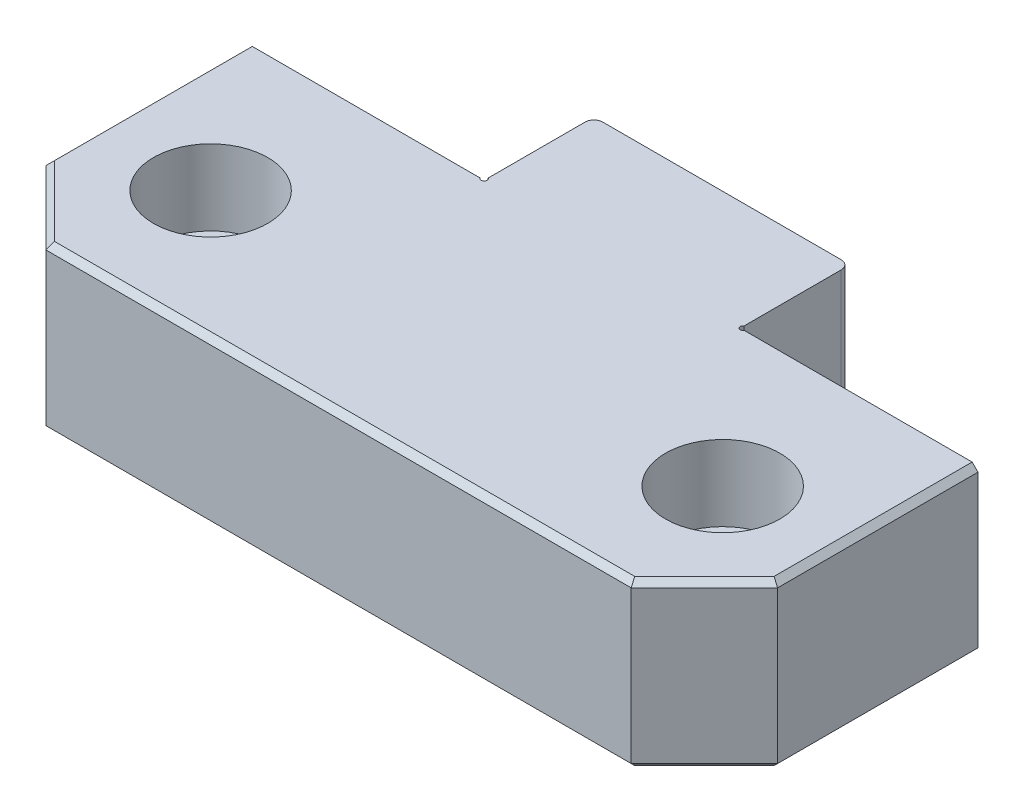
ISO-10303-21;
HEADER;
FILE_DESCRIPTION(('STEP AP214'),'2;1');
FILE_NAME('part.step','',(''),(''),'','','');
FILE_SCHEMA(('AUTOMOTIVE_DESIGN { 1 0 10303 214 1 1 1 1 }'));
ENDSEC;
DATA;
#1=APPLICATION_CONTEXT('core data for automotive mechanical design processes');
#2=APPLICATION_PROTOCOL_DEFINITION('international standard','automotive_design',2000,#1);
#3=PRODUCT_CONTEXT('',#1,'mechanical');
#4=PRODUCT('Part','Part','',(#3));
#5=PRODUCT_RELATED_PRODUCT_CATEGORY('part','',(#4));
#6=PRODUCT_DEFINITION_FORMATION('','',#4);
#7=PRODUCT_DEFINITION_CONTEXT('part definition',#1,'design');
#8=PRODUCT_DEFINITION('design','',#6,#7);
#9=PRODUCT_DEFINITION_SHAPE('','',#8);
#10=(LENGTH_UNIT() NAMED_UNIT(*) SI_UNIT(.MILLI.,.METRE.));
#11=(NAMED_UNIT(*) PLANE_ANGLE_UNIT() SI_UNIT($,.RADIAN.));
#12=(NAMED_UNIT(*) SI_UNIT($,.STERADIAN.) SOLID_ANGLE_UNIT());
#13=UNCERTAINTY_MEASURE_WITH_UNIT(LENGTH_MEASURE(1.E-05),#10,'distance_accuracy_value','');
#14=(GEOMETRIC_REPRESENTATION_CONTEXT(3) GLOBAL_UNCERTAINTY_ASSIGNED_CONTEXT((#13)) GLOBAL_UNIT_ASSIGNED_CONTEXT((#10,
#11,#12)) REPRESENTATION_CONTEXT('',''));
#15=CARTESIAN_POINT('',(0.,0.,0.));
#16=DIRECTION('',(0.,0.,1.));
#17=DIRECTION('',(1.,0.,0.));
#18=AXIS2_PLACEMENT_3D('',#15,#16,#17);
#19=CARTESIAN_POINT('',(-44.45,15.748,25.273));
#20=DIRECTION('',(0.,-1.,0.));
#21=DIRECTION('',(0.,0.,-1.));
#22=AXIS2_PLACEMENT_3D('',#19,#20,#21);
#23=CYLINDRICAL_SURFACE('',#22,6.7437);
#24=CARTESIAN_POINT('',(-44.45,0.,25.273));
#25=DIRECTION('',(0.,-1.,0.));
#26=DIRECTION('',(0.,0.,-1.));
#27=AXIS2_PLACEMENT_3D('',#24,#25,#26);
#28=CIRCLE('',#27,6.7437);
#29=CARTESIAN_POINT('',(-44.45,0.,18.5293));
#30=VERTEX_POINT('',#29);
#31=EDGE_CURVE('E250',#30,#30,#28,.T.);
#32=ORIENTED_EDGE('',*,*,#31,.T.);
#33=EDGE_LOOP('',(#32));
#34=FACE_BOUND('',#33,.T.);
#35=CARTESIAN_POINT('',(-44.45,15.3416,25.273));
#36=DIRECTION('',(0.,1.,0.));
#37=DIRECTION('',(0.,0.,1.));
#38=AXIS2_PLACEMENT_3D('',#35,#36,#37);
#39=CIRCLE('',#38,6.7437);
#40=CARTESIAN_POINT('',(-44.45,15.3416,32.0167));
#41=VERTEX_POINT('',#40);
#42=EDGE_CURVE('E252',#41,#41,#39,.F.);
#43=ORIENTED_EDGE('',*,*,#42,.F.);
#44=EDGE_LOOP('',(#43));
#45=FACE_BOUND('',#44,.T.);
#46=ADVANCED_FACE('F32',(#34,#45),#23,.F.);
#47=CARTESIAN_POINT('',(44.45,15.748,25.273));
#48=DIRECTION('',(0.,-1.,0.));
#49=DIRECTION('',(0.,0.,-1.));
#50=AXIS2_PLACEMENT_3D('',#47,#48,#49);
#51=CYLINDRICAL_SURFACE('',#50,6.7437);
#52=CARTESIAN_POINT('',(44.45,0.,25.273));
#53=DIRECTION('',(0.,-1.,0.));
#54=DIRECTION('',(0.,0.,-1.));
#55=AXIS2_PLACEMENT_3D('',#52,#53,#54);
#56=CIRCLE('',#55,6.7437);
#57=CARTESIAN_POINT('',(44.45,0.,18.5293));
#58=VERTEX_POINT('',#57);
#59=EDGE_CURVE('E210',#58,#58,#56,.T.);
#60=ORIENTED_EDGE('',*,*,#59,.T.);
#61=EDGE_LOOP('',(#60));
#62=FACE_BOUND('',#61,.T.);
#63=CARTESIAN_POINT('',(44.45,15.3416,25.273));
#64=DIRECTION('',(0.,1.,0.));
#65=DIRECTION('',(0.,0.,1.));
#66=AXIS2_PLACEMENT_3D('',#63,#64,#65);
#67=CIRCLE('',#66,6.7437);
#68=CARTESIAN_POINT('',(44.45,15.3416,32.0167));
#69=VERTEX_POINT('',#68);
#70=EDGE_CURVE('E247',#69,#69,#67,.F.);
#71=ORIENTED_EDGE('',*,*,#70,.F.);
#72=EDGE_LOOP('',(#71));
#73=FACE_BOUND('',#72,.T.);
#74=ADVANCED_FACE('F491',(#62,#73),#51,.F.);
#75=CARTESIAN_POINT('',(-63.5,28.448,47.498));
#76=DIRECTION('',(1.,0.,0.));
#77=DIRECTION('',(0.,0.,-1.));
#78=AXIS2_PLACEMENT_3D('',#75,#76,#77);
#79=PLANE('',#78);
#80=DIRECTION('',(0.,1.,0.));
#81=VECTOR('',#80,1.);
#82=CARTESIAN_POINT('',(-63.5,28.448,34.7979999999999));
#83=LINE('',#82,#81);
#84=CARTESIAN_POINT('',(-63.5,1.01599999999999,34.7979999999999));
#85=VERTEX_POINT('',#84);
#86=CARTESIAN_POINT('',(-63.5,27.432,34.7979999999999));
#87=VERTEX_POINT('',#86);
#88=EDGE_CURVE('E243',#85,#87,#83,.T.);
#89=ORIENTED_EDGE('',*,*,#88,.T.);
#90=DIRECTION('',(0.,0.,-1.));
#91=VECTOR('',#90,1.);
#92=CARTESIAN_POINT('',(-63.5,27.432,0.));
#93=LINE('',#92,#91);
#94=CARTESIAN_POINT('',(-63.5,27.432,0.));
#95=VERTEX_POINT('',#94);
#96=EDGE_CURVE('E284',#87,#95,#93,.T.);
#97=ORIENTED_EDGE('',*,*,#96,.T.);
#98=DIRECTION('',(0.,-1.,0.));
#99=VECTOR('',#98,1.);
#100=CARTESIAN_POINT('',(-63.5,28.448,0.));
#101=LINE('',#100,#99);
#102=CARTESIAN_POINT('',(-63.5,1.016,0.));
#103=VERTEX_POINT('',#102);
#104=EDGE_CURVE('E217',#95,#103,#101,.T.);
#105=ORIENTED_EDGE('',*,*,#104,.T.);
#106=DIRECTION('',(0.,0.,1.));
#107=VECTOR('',#106,1.);
#108=CARTESIAN_POINT('',(-63.5,1.01599999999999,47.498));
#109=LINE('',#108,#107);
#110=EDGE_CURVE('E281',#103,#85,#109,.T.);
#111=ORIENTED_EDGE('',*,*,#110,.T.);
#112=EDGE_LOOP('',(#89,#97,#105,#111));
#113=FACE_BOUND('',#112,.T.);
#114=ADVANCED_FACE('F388',(#113),#79,.F.);
#115=CARTESIAN_POINT('',(-63.5,28.448,47.498));
#116=DIRECTION('',(0.,0.,-1.));
#117=DIRECTION('',(-1.,0.,0.));
#118=AXIS2_PLACEMENT_3D('',#115,#116,#117);
#119=PLANE('',#118);
#120=DIRECTION('',(0.,1.,0.));
#121=VECTOR('',#120,1.);
#122=CARTESIAN_POINT('',(50.7999999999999,28.448,47.498));
#123=LINE('',#122,#121);
#124=CARTESIAN_POINT('',(50.7999999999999,1.01599999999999,47.498));
#125=VERTEX_POINT('',#124);
#126=CARTESIAN_POINT('',(50.7999999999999,27.432,47.498));
#127=VERTEX_POINT('',#126);
#128=EDGE_CURVE('E240',#125,#127,#123,.T.);
#129=ORIENTED_EDGE('',*,*,#128,.T.);
#130=DIRECTION('',(-1.,0.,0.));
#131=VECTOR('',#130,1.);
#132=CARTESIAN_POINT('',(-50.8,27.432,47.498));
#133=LINE('',#132,#131);
#134=CARTESIAN_POINT('',(-50.8,27.432,47.498));
#135=VERTEX_POINT('',#134);
#136=EDGE_CURVE('E308',#127,#135,#133,.T.);
#137=ORIENTED_EDGE('',*,*,#136,.T.);
#138=DIRECTION('',(0.,-1.,0.));
#139=VECTOR('',#138,1.);
#140=CARTESIAN_POINT('',(-50.8,28.448,47.498));
#141=LINE('',#140,#139);
#142=CARTESIAN_POINT('',(-50.8,1.01599999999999,47.498));
#143=VERTEX_POINT('',#142);
#144=EDGE_CURVE('E237',#135,#143,#141,.T.);
#145=ORIENTED_EDGE('',*,*,#144,.T.);
#146=DIRECTION('',(1.,0.,0.));
#147=VECTOR('',#146,1.);
#148=CARTESIAN_POINT('',(-63.5,1.01599999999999,47.498));
#149=LINE('',#148,#147);
#150=EDGE_CURVE('E306',#143,#125,#149,.T.);
#151=ORIENTED_EDGE('',*,*,#150,.T.);
#152=EDGE_LOOP('',(#129,#137,#145,#151));
#153=FACE_BOUND('',#152,.T.);
#154=ADVANCED_FACE('F367',(#153),#119,.F.);
#155=CARTESIAN_POINT('',(63.5,28.448,47.498));
#156=DIRECTION('',(-1.,0.,0.));
#157=DIRECTION('',(0.,0.,1.));
#158=AXIS2_PLACEMENT_3D('',#155,#156,#157);
#159=PLANE('',#158);
#160=DIRECTION('',(0.,-1.,0.));
#161=VECTOR('',#160,1.);
#162=CARTESIAN_POINT('',(63.5,28.448,0.));
#163=LINE('',#162,#161);
#164=CARTESIAN_POINT('',(63.5,27.432,0.));
#165=VERTEX_POINT('',#164);
#166=CARTESIAN_POINT('',(63.5,1.01599999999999,0.));
#167=VERTEX_POINT('',#166);
#168=EDGE_CURVE('E231',#165,#167,#163,.T.);
#169=ORIENTED_EDGE('',*,*,#168,.F.);
#170=DIRECTION('',(0.,0.,1.));
#171=VECTOR('',#170,1.);
#172=CARTESIAN_POINT('',(63.5,27.432,34.798));
#173=LINE('',#172,#171);
#174=CARTESIAN_POINT('',(63.5,27.432,34.798));
#175=VERTEX_POINT('',#174);
#176=EDGE_CURVE('E300',#165,#175,#173,.T.);
#177=ORIENTED_EDGE('',*,*,#176,.T.);
#178=DIRECTION('',(0.,-1.,0.));
#179=VECTOR('',#178,1.);
#180=CARTESIAN_POINT('',(63.5,28.448,34.798));
#181=LINE('',#180,#179);
#182=CARTESIAN_POINT('',(63.5,1.01599999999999,34.798));
#183=VERTEX_POINT('',#182);
#184=EDGE_CURVE('E234',#175,#183,#181,.T.);
#185=ORIENTED_EDGE('',*,*,#184,.T.);
#186=DIRECTION('',(0.,0.,-1.));
#187=VECTOR('',#186,1.);
#188=CARTESIAN_POINT('',(63.5,1.01599999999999,47.498));
#189=LINE('',#188,#187);
#190=EDGE_CURVE('E298',#183,#167,#189,.T.);
#191=ORIENTED_EDGE('',*,*,#190,.T.);
#192=EDGE_LOOP('',(#169,#177,#185,#191));
#193=FACE_BOUND('',#192,.T.);
#194=ADVANCED_FACE('F350',(#193),#159,.F.);
#195=CARTESIAN_POINT('',(22.9111919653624,28.448,0.));
#196=DIRECTION('',(0.,0.,1.));
#197=DIRECTION('',(1.,0.,0.));
#198=AXIS2_PLACEMENT_3D('',#195,#196,#197);
#199=PLANE('',#198);
#200=DIRECTION('',(-1.,0.,0.));
#201=VECTOR('',#200,1.);
#202=CARTESIAN_POINT('',(22.9111919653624,28.448,0.));
#203=LINE('',#202,#201);
#204=CARTESIAN_POINT('',(62.484,28.448,0.));
#205=VERTEX_POINT('',#204);
#206=CARTESIAN_POINT('',(22.9111919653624,28.448,0.));
#207=VERTEX_POINT('',#206);
#208=EDGE_CURVE('E216',#205,#207,#203,.T.);
#209=ORIENTED_EDGE('',*,*,#208,.F.);
#210=DIRECTION('',(0.707106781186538,-0.707106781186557,0.));
#211=VECTOR('',#210,1.);
#212=CARTESIAN_POINT('',(62.484,28.448,0.));
#213=LINE('',#212,#211);
#214=EDGE_CURVE('E296',#205,#165,#213,.T.);
#215=ORIENTED_EDGE('',*,*,#214,.T.);
#216=ORIENTED_EDGE('',*,*,#168,.T.);
#217=DIRECTION('',(0.707106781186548,0.707106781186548,0.));
#218=VECTOR('',#217,1.);
#219=CARTESIAN_POINT('',(63.5,1.01599999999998,0.));
#220=LINE('',#219,#218);
#221=CARTESIAN_POINT('',(62.484,0.,0.));
#222=VERTEX_POINT('',#221);
#223=EDGE_CURVE('E294',#167,#222,#220,.F.);
#224=ORIENTED_EDGE('',*,*,#223,.T.);
#225=DIRECTION('',(-1.,0.,0.));
#226=VECTOR('',#225,1.);
#227=CARTESIAN_POINT('',(22.9111919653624,0.,0.));
#228=LINE('',#227,#226);
#229=CARTESIAN_POINT('',(22.9111919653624,0.,0.));
#230=VERTEX_POINT('',#229);
#231=EDGE_CURVE('E206',#222,#230,#228,.T.);
#232=ORIENTED_EDGE('',*,*,#231,.T.);
#233=DIRECTION('',(0.,-1.,0.));
#234=VECTOR('',#233,1.);
#235=CARTESIAN_POINT('',(22.9111919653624,28.448,0.));
#236=LINE('',#235,#234);
#237=EDGE_CURVE('E205',#207,#230,#236,.T.);
#238=ORIENTED_EDGE('',*,*,#237,.F.);
#239=EDGE_LOOP('',(#209,#215,#216,#224,#232,#238));
#240=FACE_BOUND('',#239,.T.);
#241=ADVANCED_FACE('F355',(#240),#199,.F.);
#242=CARTESIAN_POINT('',(22.479,28.448,-0.254));
#243=DIRECTION('',(0.,-1.,0.));
#244=DIRECTION('',(0.,0.,-1.));
#245=AXIS2_PLACEMENT_3D('',#242,#243,#244);
#246=CYLINDRICAL_SURFACE('',#245,0.501304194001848);
#247=CARTESIAN_POINT('',(22.479,0.,-0.254));
#248=DIRECTION('',(0.,-1.,0.));
#249=DIRECTION('',(0.,0.,1.));
#250=AXIS2_PLACEMENT_3D('',#247,#248,#249);
#251=CIRCLE('',#250,0.501304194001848);
#252=CARTESIAN_POINT('',(22.0468080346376,0.,0.));
#253=VERTEX_POINT('',#252);
#254=EDGE_CURVE('E197',#230,#253,#251,.T.);
#255=ORIENTED_EDGE('',*,*,#254,.T.);
#256=DIRECTION('',(0.,-1.,0.));
#257=VECTOR('',#256,1.);
#258=CARTESIAN_POINT('',(22.0468080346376,28.448,0.));
#259=LINE('',#258,#257);
#260=CARTESIAN_POINT('',(22.0468080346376,0.254000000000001,0.));
#261=VERTEX_POINT('',#260);
#262=EDGE_CURVE('E180',#253,#261,#259,.F.);
#263=ORIENTED_EDGE('',*,*,#262,.T.);
#264=CARTESIAN_POINT('',(22.479,0.254000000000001,-0.254));
#265=DIRECTION('',(0.,1.,0.));
#266=DIRECTION('',(0.,0.,1.));
#267=AXIS2_PLACEMENT_3D('',#264,#265,#266);
#268=CIRCLE('',#267,0.501304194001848);
#269=CARTESIAN_POINT('',(22.225,0.254,-0.686191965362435));
#270=VERTEX_POINT('',#269);
#271=EDGE_CURVE('E431',#261,#270,#268,.F.);
#272=ORIENTED_EDGE('',*,*,#271,.T.);
#273=DIRECTION('',(0.,-1.,0.));
#274=VECTOR('',#273,1.);
#275=CARTESIAN_POINT('',(22.225,28.448,-0.686191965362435));
#276=LINE('',#275,#274);
#277=CARTESIAN_POINT('',(22.225,28.448,-0.686191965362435));
#278=VERTEX_POINT('',#277);
#279=EDGE_CURVE('E227',#278,#270,#276,.T.);
#280=ORIENTED_EDGE('',*,*,#279,.F.);
#281=CARTESIAN_POINT('',(22.479,28.448,-0.254));
#282=DIRECTION('',(0.,-1.,0.));
#283=DIRECTION('',(0.,0.,1.));
#284=AXIS2_PLACEMENT_3D('',#281,#282,#283);
#285=CIRCLE('',#284,0.501304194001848);
#286=EDGE_CURVE('E415',#207,#278,#285,.T.);
#287=ORIENTED_EDGE('',*,*,#286,.F.);
#288=ORIENTED_EDGE('',*,*,#237,.T.);
#289=EDGE_LOOP('',(#255,#263,#272,#280,#287,#288));
#290=FACE_BOUND('',#289,.T.);
#291=ADVANCED_FACE('F202',(#290),#246,.F.);
#292=CARTESIAN_POINT('',(22.225,28.448,-19.05));
#293=DIRECTION('',(-1.,0.,0.));
#294=DIRECTION('',(0.,0.,1.));
#295=AXIS2_PLACEMENT_3D('',#292,#293,#294);
#296=PLANE('',#295);
#297=ORIENTED_EDGE('',*,*,#279,.T.);
#298=DIRECTION('',(0.,0.,1.));
#299=VECTOR('',#298,1.);
#300=CARTESIAN_POINT('',(22.225,0.254,0.));
#301=LINE('',#300,#299);
#302=CARTESIAN_POINT('',(22.225,0.254000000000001,-17.526));
#303=VERTEX_POINT('',#302);
#304=EDGE_CURVE('E437',#303,#270,#301,.T.);
#305=ORIENTED_EDGE('',*,*,#304,.F.);
#306=DIRECTION('',(0.,-1.,0.));
#307=VECTOR('',#306,1.);
#308=CARTESIAN_POINT('',(22.225,28.448,-17.526));
#309=LINE('',#308,#307);
#310=CARTESIAN_POINT('',(22.225,28.448,-17.526));
#311=VERTEX_POINT('',#310);
#312=EDGE_CURVE('E268',#303,#311,#309,.F.);
#313=ORIENTED_EDGE('',*,*,#312,.T.);
#314=DIRECTION('',(0.,0.,-1.));
#315=VECTOR('',#314,1.);
#316=CARTESIAN_POINT('',(22.225,28.448,-19.05));
#317=LINE('',#316,#315);
#318=EDGE_CURVE('E412',#278,#311,#317,.T.);
#319=ORIENTED_EDGE('',*,*,#318,.F.);
#320=EDGE_LOOP('',(#297,#305,#313,#319));
#321=FACE_BOUND('',#320,.T.);
#322=ADVANCED_FACE('F468',(#321),#296,.F.);
#323=CARTESIAN_POINT('',(-22.225,28.448,-19.05));
#324=DIRECTION('',(0.,0.,1.));
#325=DIRECTION('',(1.,0.,0.));
#326=AXIS2_PLACEMENT_3D('',#323,#324,#325);
#327=PLANE('',#326);
#328=DIRECTION('',(0.,-1.,0.));
#329=VECTOR('',#328,1.);
#330=CARTESIAN_POINT('',(20.701,28.448,-19.05));
#331=LINE('',#330,#329);
#332=CARTESIAN_POINT('',(20.701,28.448,-19.05));
#333=VERTEX_POINT('',#332);
#334=CARTESIAN_POINT('',(20.701,0.254000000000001,-19.05));
#335=VERTEX_POINT('',#334);
#336=EDGE_CURVE('E259',#333,#335,#331,.T.);
#337=ORIENTED_EDGE('',*,*,#336,.T.);
#338=DIRECTION('',(1.,0.,0.));
#339=VECTOR('',#338,1.);
#340=CARTESIAN_POINT('',(22.225,0.254,-19.05));
#341=LINE('',#340,#339);
#342=CARTESIAN_POINT('',(-20.701,0.254000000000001,-19.05));
#343=VERTEX_POINT('',#342);
#344=EDGE_CURVE('E46',#343,#335,#341,.T.);
#345=ORIENTED_EDGE('',*,*,#344,.F.);
#346=DIRECTION('',(0.,-1.,0.));
#347=VECTOR('',#346,1.);
#348=CARTESIAN_POINT('',(-20.701,28.448,-19.05));
#349=LINE('',#348,#347);
#350=CARTESIAN_POINT('',(-20.701,28.448,-19.05));
#351=VERTEX_POINT('',#350);
#352=EDGE_CURVE('E262',#343,#351,#349,.F.);
#353=ORIENTED_EDGE('',*,*,#352,.T.);
#354=DIRECTION('',(-1.,0.,0.));
#355=VECTOR('',#354,1.);
#356=CARTESIAN_POINT('',(-22.225,28.448,-19.05));
#357=LINE('',#356,#355);
#358=EDGE_CURVE('E409',#333,#351,#357,.T.);
#359=ORIENTED_EDGE('',*,*,#358,.F.);
#360=EDGE_LOOP('',(#337,#345,#353,#359));
#361=FACE_BOUND('',#360,.T.);
#362=ADVANCED_FACE('F459',(#361),#327,.F.);
#363=CARTESIAN_POINT('',(-22.225,28.448,-0.693940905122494));
#364=DIRECTION('',(1.,0.,0.));
#365=DIRECTION('',(0.,0.,-1.));
#366=AXIS2_PLACEMENT_3D('',#363,#364,#365);
#367=PLANE('',#366);
#368=DIRECTION('',(0.,-1.,0.));
#369=VECTOR('',#368,1.);
#370=CARTESIAN_POINT('',(-22.225,28.448,-17.526));
#371=LINE('',#370,#369);
#372=CARTESIAN_POINT('',(-22.225,28.448,-17.526));
#373=VERTEX_POINT('',#372);
#374=CARTESIAN_POINT('',(-22.225,0.254000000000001,-17.526));
#375=VERTEX_POINT('',#374);
#376=EDGE_CURVE('E246',#373,#375,#371,.T.);
#377=ORIENTED_EDGE('',*,*,#376,.T.);
#378=DIRECTION('',(0.,0.,-1.));
#379=VECTOR('',#378,1.);
#380=CARTESIAN_POINT('',(-22.225,0.254,-19.05));
#381=LINE('',#380,#379);
#382=CARTESIAN_POINT('',(-22.225,0.254000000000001,-0.693940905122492));
#383=VERTEX_POINT('',#382);
#384=EDGE_CURVE('E441',#383,#375,#381,.T.);
#385=ORIENTED_EDGE('',*,*,#384,.F.);
#386=DIRECTION('',(0.,-1.,0.));
#387=VECTOR('',#386,1.);
#388=CARTESIAN_POINT('',(-22.225,28.448,-0.693940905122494));
#389=LINE('',#388,#387);
#390=CARTESIAN_POINT('',(-22.225,28.448,-0.693940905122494));
#391=VERTEX_POINT('',#390);
#392=EDGE_CURVE('E224',#391,#383,#389,.T.);
#393=ORIENTED_EDGE('',*,*,#392,.F.);
#394=DIRECTION('',(0.,0.,1.));
#395=VECTOR('',#394,1.);
#396=CARTESIAN_POINT('',(-22.225,28.448,-0.693940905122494));
#397=LINE('',#396,#395);
#398=EDGE_CURVE('E405',#373,#391,#397,.T.);
#399=ORIENTED_EDGE('',*,*,#398,.F.);
#400=EDGE_LOOP('',(#377,#385,#393,#399));
#401=FACE_BOUND('',#400,.T.);
#402=ADVANCED_FACE('F450',(#401),#367,.F.);
#403=CARTESIAN_POINT('',(-22.479,28.448,-0.254));
#404=DIRECTION('',(0.,-1.,0.));
#405=DIRECTION('',(0.,0.,-1.));
#406=AXIS2_PLACEMENT_3D('',#403,#404,#405);
#407=CYLINDRICAL_SURFACE('',#406,0.508);
#408=CARTESIAN_POINT('',(-22.479,0.254000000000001,-0.254));
#409=DIRECTION('',(0.,1.,0.));
#410=DIRECTION('',(0.,0.,1.));
#411=AXIS2_PLACEMENT_3D('',#408,#409,#410);
#412=CIRCLE('',#411,0.508);
#413=CARTESIAN_POINT('',(-22.0390590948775,0.254000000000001,0.));
#414=VERTEX_POINT('',#413);
#415=EDGE_CURVE('E433',#383,#414,#412,.F.);
#416=ORIENTED_EDGE('',*,*,#415,.T.);
#417=DIRECTION('',(0.,-1.,0.));
#418=VECTOR('',#417,1.);
#419=CARTESIAN_POINT('',(-22.0390590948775,28.448,0.));
#420=LINE('',#419,#418);
#421=CARTESIAN_POINT('',(-22.0390590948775,0.,0.));
#422=VERTEX_POINT('',#421);
#423=EDGE_CURVE('E191',#414,#422,#420,.T.);
#424=ORIENTED_EDGE('',*,*,#423,.T.);
#425=CARTESIAN_POINT('',(-22.479,0.,-0.254));
#426=DIRECTION('',(0.,-1.,0.));
#427=DIRECTION('',(0.,0.,1.));
#428=AXIS2_PLACEMENT_3D('',#425,#426,#427);
#429=CIRCLE('',#428,0.508);
#430=CARTESIAN_POINT('',(-22.9189409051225,0.,0.));
#431=VERTEX_POINT('',#430);
#432=EDGE_CURVE('E199',#422,#431,#429,.T.);
#433=ORIENTED_EDGE('',*,*,#432,.T.);
#434=DIRECTION('',(0.,-1.,0.));
#435=VECTOR('',#434,1.);
#436=CARTESIAN_POINT('',(-22.9189409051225,28.448,0.));
#437=LINE('',#436,#435);
#438=CARTESIAN_POINT('',(-22.9189409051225,28.448,0.));
#439=VERTEX_POINT('',#438);
#440=EDGE_CURVE('E220',#439,#431,#437,.T.);
#441=ORIENTED_EDGE('',*,*,#440,.F.);
#442=CARTESIAN_POINT('',(-22.479,28.448,-0.254));
#443=DIRECTION('',(0.,-1.,0.));
#444=DIRECTION('',(0.,0.,1.));
#445=AXIS2_PLACEMENT_3D('',#442,#443,#444);
#446=CIRCLE('',#445,0.508);
#447=EDGE_CURVE('E403',#391,#439,#446,.T.);
#448=ORIENTED_EDGE('',*,*,#447,.F.);
#449=ORIENTED_EDGE('',*,*,#392,.T.);
#450=EDGE_LOOP('',(#416,#424,#433,#441,#448,#449));
#451=FACE_BOUND('',#450,.T.);
#452=ADVANCED_FACE('F446',(#451),#407,.F.);
#453=CARTESIAN_POINT('',(-63.5,28.448,0.));
#454=DIRECTION('',(0.,0.,1.));
#455=DIRECTION('',(1.,0.,0.));
#456=AXIS2_PLACEMENT_3D('',#453,#454,#455);
#457=PLANE('',#456);
#458=ORIENTED_EDGE('',*,*,#104,.F.);
#459=DIRECTION('',(0.707106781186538,0.707106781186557,0.));
#460=VECTOR('',#459,1.);
#461=CARTESIAN_POINT('',(-62.484,28.448,0.));
#462=LINE('',#461,#460);
#463=CARTESIAN_POINT('',(-62.484,28.448,0.));
#464=VERTEX_POINT('',#463);
#465=EDGE_CURVE('E288',#95,#464,#462,.T.);
#466=ORIENTED_EDGE('',*,*,#465,.T.);
#467=DIRECTION('',(-1.,0.,0.));
#468=VECTOR('',#467,1.);
#469=CARTESIAN_POINT('',(-63.5,28.448,0.));
#470=LINE('',#469,#468);
#471=EDGE_CURVE('E221',#439,#464,#470,.T.);
#472=ORIENTED_EDGE('',*,*,#471,.F.);
#473=ORIENTED_EDGE('',*,*,#440,.T.);
#474=DIRECTION('',(-1.,0.,0.));
#475=VECTOR('',#474,1.);
#476=CARTESIAN_POINT('',(-63.5,0.,0.));
#477=LINE('',#476,#475);
#478=CARTESIAN_POINT('',(-62.484,0.,0.));
#479=VERTEX_POINT('',#478);
#480=EDGE_CURVE('E208',#431,#479,#477,.T.);
#481=ORIENTED_EDGE('',*,*,#480,.T.);
#482=DIRECTION('',(0.707106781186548,-0.707106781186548,0.));
#483=VECTOR('',#482,1.);
#484=CARTESIAN_POINT('',(-63.5,1.01599999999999,0.));
#485=LINE('',#484,#483);
#486=EDGE_CURVE('E286',#479,#103,#485,.F.);
#487=ORIENTED_EDGE('',*,*,#486,.T.);
#488=EDGE_LOOP('',(#458,#466,#472,#473,#481,#487));
#489=FACE_BOUND('',#488,.T.);
#490=ADVANCED_FACE('F398',(#489),#457,.F.);
#491=CARTESIAN_POINT('',(-22.479,28.448,-0.254));
#492=DIRECTION('',(0.,1.,0.));
#493=DIRECTION('',(0.,0.,1.));
#494=AXIS2_PLACEMENT_3D('',#491,#492,#493);
#495=PLANE('',#494);
#496=ORIENTED_EDGE('',*,*,#471,.T.);
#497=DIRECTION('',(0.,0.,1.));
#498=VECTOR('',#497,1.);
#499=CARTESIAN_POINT('',(-62.484,28.448,34.7979999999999));
#500=LINE('',#499,#498);
#501=CARTESIAN_POINT('',(-62.484,28.448,34.3771590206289));
#502=VERTEX_POINT('',#501);
#503=EDGE_CURVE('E278',#464,#502,#500,.T.);
#504=ORIENTED_EDGE('',*,*,#503,.T.);
#505=DIRECTION('',(0.707106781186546,0.,0.707106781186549));
#506=VECTOR('',#505,1.);
#507=CARTESIAN_POINT('',(-59.7970795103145,28.448,37.0640795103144));
#508=LINE('',#507,#506);
#509=CARTESIAN_POINT('',(-50.3791590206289,28.448,46.482));
#510=VERTEX_POINT('',#509);
#511=EDGE_CURVE('E276',#502,#510,#508,.T.);
#512=ORIENTED_EDGE('',*,*,#511,.T.);
#513=DIRECTION('',(1.,0.,0.));
#514=VECTOR('',#513,1.);
#515=CARTESIAN_POINT('',(50.7999999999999,28.448,46.482));
#516=LINE('',#515,#514);
#517=CARTESIAN_POINT('',(50.3791590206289,28.448,46.482));
#518=VERTEX_POINT('',#517);
#519=EDGE_CURVE('E270',#510,#518,#516,.T.);
#520=ORIENTED_EDGE('',*,*,#519,.T.);
#521=DIRECTION('',(0.707106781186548,0.,-0.707106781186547));
#522=VECTOR('',#521,1.);
#523=CARTESIAN_POINT('',(37.3180795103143,28.448,59.5430795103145));
#524=LINE('',#523,#522);
#525=CARTESIAN_POINT('',(62.484,28.448,34.3771590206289));
#526=VERTEX_POINT('',#525);
#527=EDGE_CURVE('E272',#518,#526,#524,.T.);
#528=ORIENTED_EDGE('',*,*,#527,.T.);
#529=DIRECTION('',(0.,0.,-1.));
#530=VECTOR('',#529,1.);
#531=CARTESIAN_POINT('',(62.484,28.448,0.));
#532=LINE('',#531,#530);
#533=EDGE_CURVE('E274',#526,#205,#532,.T.);
#534=ORIENTED_EDGE('',*,*,#533,.T.);
#535=ORIENTED_EDGE('',*,*,#208,.T.);
#536=ORIENTED_EDGE('',*,*,#286,.T.);
#537=ORIENTED_EDGE('',*,*,#318,.T.);
#538=CARTESIAN_POINT('',(20.701,28.448,-17.526));
#539=DIRECTION('',(0.,1.,0.));
#540=DIRECTION('',(0.,0.,1.));
#541=AXIS2_PLACEMENT_3D('',#538,#539,#540);
#542=CIRCLE('',#541,1.524);
#543=EDGE_CURVE('E264',#311,#333,#542,.T.);
#544=ORIENTED_EDGE('',*,*,#543,.T.);
#545=ORIENTED_EDGE('',*,*,#358,.T.);
#546=CARTESIAN_POINT('',(-20.701,28.448,-17.526));
#547=DIRECTION('',(0.,1.,0.));
#548=DIRECTION('',(0.,0.,1.));
#549=AXIS2_PLACEMENT_3D('',#546,#547,#548);
#550=CIRCLE('',#549,1.524);
#551=EDGE_CURVE('E266',#351,#373,#550,.T.);
#552=ORIENTED_EDGE('',*,*,#551,.T.);
#553=ORIENTED_EDGE('',*,*,#398,.T.);
#554=ORIENTED_EDGE('',*,*,#447,.T.);
#555=EDGE_LOOP('',(#496,#504,#512,#520,#528,#534,#535,#536,#537,#544,#545,#552,#553,#554));
#556=FACE_BOUND('',#555,.T.);
#557=CARTESIAN_POINT('',(-44.45,28.448,25.273));
#558=DIRECTION('',(0.,1.,0.));
#559=DIRECTION('',(0.,0.,1.));
#560=AXIS2_PLACEMENT_3D('',#557,#558,#559);
#561=CIRCLE('',#560,9.9187);
#562=CARTESIAN_POINT('',(-44.45,28.448,35.1917));
#563=VERTEX_POINT('',#562);
#564=EDGE_CURVE('E330',#563,#563,#561,.T.);
#565=ORIENTED_EDGE('',*,*,#564,.F.);
#566=EDGE_LOOP('',(#565));
#567=FACE_BOUND('',#566,.T.);
#568=CARTESIAN_POINT('',(44.45,28.448,25.273));
#569=DIRECTION('',(0.,1.,0.));
#570=DIRECTION('',(0.,0.,1.));
#571=AXIS2_PLACEMENT_3D('',#568,#569,#570);
#572=CIRCLE('',#571,9.9187);
#573=CARTESIAN_POINT('',(44.45,28.448,35.1917));
#574=VERTEX_POINT('',#573);
#575=EDGE_CURVE('E255',#574,#574,#572,.T.);
#576=ORIENTED_EDGE('',*,*,#575,.F.);
#577=EDGE_LOOP('',(#576));
#578=FACE_BOUND('',#577,.T.);
#579=ADVANCED_FACE('F400',(#556,#567,#578),#495,.T.);
#580=CARTESIAN_POINT('',(-22.479,0.,-0.254));
#581=DIRECTION('',(0.,1.,0.));
#582=DIRECTION('',(0.,0.,1.));
#583=AXIS2_PLACEMENT_3D('',#580,#581,#582);
#584=PLANE('',#583);
#585=ORIENTED_EDGE('',*,*,#31,.F.);
#586=EDGE_LOOP('',(#585));
#587=FACE_BOUND('',#586,.T.);
#588=ORIENTED_EDGE('',*,*,#59,.F.);
#589=EDGE_LOOP('',(#588));
#590=FACE_BOUND('',#589,.T.);
#591=ORIENTED_EDGE('',*,*,#432,.F.);
#592=DIRECTION('',(-1.,0.,0.));
#593=VECTOR('',#592,1.);
#594=CARTESIAN_POINT('',(22.225,0.,0.));
#595=LINE('',#594,#593);
#596=EDGE_CURVE('E183',#253,#422,#595,.T.);
#597=ORIENTED_EDGE('',*,*,#596,.F.);
#598=ORIENTED_EDGE('',*,*,#254,.F.);
#599=ORIENTED_EDGE('',*,*,#231,.F.);
#600=DIRECTION('',(0.,0.,1.));
#601=VECTOR('',#600,1.);
#602=CARTESIAN_POINT('',(62.484,0.,-0.253999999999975));
#603=LINE('',#602,#601);
#604=CARTESIAN_POINT('',(62.484,0.,34.3771590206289));
#605=VERTEX_POINT('',#604);
#606=EDGE_CURVE('E310',#222,#605,#603,.T.);
#607=ORIENTED_EDGE('',*,*,#606,.T.);
#608=DIRECTION('',(-0.707106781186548,0.,0.707106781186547));
#609=VECTOR('',#608,1.);
#610=CARTESIAN_POINT('',(50.0815795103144,0.,46.7795795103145));
#611=LINE('',#610,#609);
#612=CARTESIAN_POINT('',(50.3791590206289,0.,46.482));
#613=VERTEX_POINT('',#612);
#614=EDGE_CURVE('E312',#605,#613,#611,.T.);
#615=ORIENTED_EDGE('',*,*,#614,.T.);
#616=DIRECTION('',(-1.,0.,0.));
#617=VECTOR('',#616,1.);
#618=CARTESIAN_POINT('',(-22.479,0.,46.482));
#619=LINE('',#618,#617);
#620=CARTESIAN_POINT('',(-50.3791590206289,0.,46.482));
#621=VERTEX_POINT('',#620);
#622=EDGE_CURVE('E314',#613,#621,#619,.T.);
#623=ORIENTED_EDGE('',*,*,#622,.T.);
#624=DIRECTION('',(-0.707106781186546,0.,-0.707106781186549));
#625=VECTOR('',#624,1.);
#626=CARTESIAN_POINT('',(-62.7815795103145,0.,34.0795795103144));
#627=LINE('',#626,#625);
#628=CARTESIAN_POINT('',(-62.484,0.,34.3771590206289));
#629=VERTEX_POINT('',#628);
#630=EDGE_CURVE('E54',#621,#629,#627,.T.);
#631=ORIENTED_EDGE('',*,*,#630,.T.);
#632=DIRECTION('',(0.,0.,-1.));
#633=VECTOR('',#632,1.);
#634=CARTESIAN_POINT('',(-62.484,0.,-0.254));
#635=LINE('',#634,#633);
#636=EDGE_CURVE('E40',#629,#479,#635,.T.);
#637=ORIENTED_EDGE('',*,*,#636,.T.);
#638=ORIENTED_EDGE('',*,*,#480,.F.);
#639=EDGE_LOOP('',(#591,#597,#598,#599,#607,#615,#623,#631,#637,#638));
#640=FACE_BOUND('',#639,.T.);
#641=ADVANCED_FACE('F195',(#587,#590,#640),#584,.F.);
#642=CARTESIAN_POINT('',(63.5,28.448,34.798));
#643=DIRECTION('',(-0.707106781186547,0.,-0.707106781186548));
#644=DIRECTION('',(-0.707106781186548,0.,0.707106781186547));
#645=AXIS2_PLACEMENT_3D('',#642,#643,#644);
#646=PLANE('',#645);
#647=ORIENTED_EDGE('',*,*,#184,.F.);
#648=DIRECTION('',(0.707106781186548,0.,-0.707106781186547));
#649=VECTOR('',#648,1.);
#650=CARTESIAN_POINT('',(63.5,27.432,34.798));
#651=LINE('',#650,#649);
#652=EDGE_CURVE('E304',#175,#127,#651,.F.);
#653=ORIENTED_EDGE('',*,*,#652,.T.);
#654=ORIENTED_EDGE('',*,*,#128,.F.);
#655=DIRECTION('',(-0.707106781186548,0.,0.707106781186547));
#656=VECTOR('',#655,1.);
#657=CARTESIAN_POINT('',(63.5,1.01599999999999,34.798));
#658=LINE('',#657,#656);
#659=EDGE_CURVE('E302',#125,#183,#658,.F.);
#660=ORIENTED_EDGE('',*,*,#659,.T.);
#661=EDGE_LOOP('',(#647,#653,#654,#660));
#662=FACE_BOUND('',#661,.T.);
#663=ADVANCED_FACE('F363',(#662),#646,.F.);
#664=CARTESIAN_POINT('',(-50.8,28.448,47.498));
#665=DIRECTION('',(0.707106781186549,0.,-0.707106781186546));
#666=DIRECTION('',(-0.707106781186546,0.,-0.707106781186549));
#667=AXIS2_PLACEMENT_3D('',#664,#665,#666);
#668=PLANE('',#667);
#669=ORIENTED_EDGE('',*,*,#144,.F.);
#670=DIRECTION('',(0.707106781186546,0.,0.707106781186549));
#671=VECTOR('',#670,1.);
#672=CARTESIAN_POINT('',(-50.8,27.432,47.498));
#673=LINE('',#672,#671);
#674=EDGE_CURVE('E292',#135,#87,#673,.F.);
#675=ORIENTED_EDGE('',*,*,#674,.T.);
#676=ORIENTED_EDGE('',*,*,#88,.F.);
#677=DIRECTION('',(-0.707106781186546,0.,-0.707106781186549));
#678=VECTOR('',#677,1.);
#679=CARTESIAN_POINT('',(-50.8,1.01599999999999,47.498));
#680=LINE('',#679,#678);
#681=EDGE_CURVE('E290',#85,#143,#680,.F.);
#682=ORIENTED_EDGE('',*,*,#681,.T.);
#683=EDGE_LOOP('',(#669,#675,#676,#682));
#684=FACE_BOUND('',#683,.T.);
#685=ADVANCED_FACE('F385',(#684),#668,.F.);
#686=CARTESIAN_POINT('',(44.45,15.3416,25.273));
#687=DIRECTION('',(0.,1.,0.));
#688=DIRECTION('',(0.,0.,1.));
#689=AXIS2_PLACEMENT_3D('',#686,#687,#688);
#690=PLANE('',#689);
#691=CARTESIAN_POINT('',(44.45,15.3416,25.273));
#692=DIRECTION('',(0.,1.,0.));
#693=DIRECTION('',(0.,0.,1.));
#694=AXIS2_PLACEMENT_3D('',#691,#692,#693);
#695=CIRCLE('',#694,9.9187);
#696=CARTESIAN_POINT('',(44.45,15.3416,35.1917));
#697=VERTEX_POINT('',#696);
#698=EDGE_CURVE('E251',#697,#697,#695,.T.);
#699=ORIENTED_EDGE('',*,*,#698,.T.);
#700=EDGE_LOOP('',(#699));
#701=FACE_BOUND('',#700,.T.);
#702=ORIENTED_EDGE('',*,*,#70,.T.);
#703=EDGE_LOOP('',(#702));
#704=FACE_BOUND('',#703,.T.);
#705=ADVANCED_FACE('F533',(#701,#704),#690,.T.);
#706=CARTESIAN_POINT('',(44.45,15.3416,25.273));
#707=DIRECTION('',(0.,1.,0.));
#708=DIRECTION('',(0.,0.,1.));
#709=AXIS2_PLACEMENT_3D('',#706,#707,#708);
#710=CYLINDRICAL_SURFACE('',#709,9.9187);
#711=CARTESIAN_POINT('',(44.45,15.3416,35.1917));
#712=CARTESIAN_POINT('',(44.45,15.478125,35.1917));
#713=CARTESIAN_POINT('',(44.45,15.61465,35.1917));
#714=CARTESIAN_POINT('',(44.45,15.8877,35.1917));
#715=CARTESIAN_POINT('',(44.45,16.024225,35.1917));
#716=CARTESIAN_POINT('',(44.45,16.297275,35.1917));
#717=CARTESIAN_POINT('',(44.45,16.4338,35.1917));
#718=CARTESIAN_POINT('',(44.45,16.70685,35.1917));
#719=CARTESIAN_POINT('',(44.45,16.843375,35.1917));
#720=CARTESIAN_POINT('',(44.45,17.116425,35.1917));
#721=CARTESIAN_POINT('',(44.45,17.25295,35.1917));
#722=CARTESIAN_POINT('',(44.45,17.526,35.1917));
#723=CARTESIAN_POINT('',(44.45,17.662525,35.1917));
#724=CARTESIAN_POINT('',(44.45,17.935575,35.1917));
#725=CARTESIAN_POINT('',(44.45,18.0721,35.1917));
#726=CARTESIAN_POINT('',(44.45,18.34515,35.1917));
#727=CARTESIAN_POINT('',(44.45,18.481675,35.1917));
#728=CARTESIAN_POINT('',(44.45,18.754725,35.1917));
#729=CARTESIAN_POINT('',(44.45,18.89125,35.1917));
#730=CARTESIAN_POINT('',(44.45,19.1643,35.1917));
#731=CARTESIAN_POINT('',(44.45,19.300825,35.1917));
#732=CARTESIAN_POINT('',(44.45,19.573875,35.1917));
#733=CARTESIAN_POINT('',(44.45,19.7104,35.1917));
#734=CARTESIAN_POINT('',(44.45,19.98345,35.1917));
#735=CARTESIAN_POINT('',(44.45,20.119975,35.1917));
#736=CARTESIAN_POINT('',(44.45,20.393025,35.1917));
#737=CARTESIAN_POINT('',(44.45,20.52955,35.1917));
#738=CARTESIAN_POINT('',(44.45,20.8026,35.1917));
#739=CARTESIAN_POINT('',(44.45,20.939125,35.1917));
#740=CARTESIAN_POINT('',(44.45,21.212175,35.1917));
#741=CARTESIAN_POINT('',(44.45,21.3487,35.1917));
#742=CARTESIAN_POINT('',(44.45,21.62175,35.1917));
#743=CARTESIAN_POINT('',(44.45,21.758275,35.1917));
#744=CARTESIAN_POINT('',(44.45,22.031325,35.1917));
#745=CARTESIAN_POINT('',(44.45,22.16785,35.1917));
#746=CARTESIAN_POINT('',(44.45,22.4409,35.1917));
#747=CARTESIAN_POINT('',(44.45,22.577425,35.1917));
#748=CARTESIAN_POINT('',(44.45,22.850475,35.1917));
#749=CARTESIAN_POINT('',(44.45,22.987,35.1917));
#750=CARTESIAN_POINT('',(44.45,23.26005,35.1917));
#751=CARTESIAN_POINT('',(44.45,23.396575,35.1917));
#752=CARTESIAN_POINT('',(44.45,23.669625,35.1917));
#753=CARTESIAN_POINT('',(44.45,23.80615,35.1917));
#754=CARTESIAN_POINT('',(44.45,24.0792,35.1917));
#755=CARTESIAN_POINT('',(44.45,24.215725,35.1917));
#756=CARTESIAN_POINT('',(44.45,24.488775,35.1917));
#757=CARTESIAN_POINT('',(44.45,24.6253,35.1917));
#758=CARTESIAN_POINT('',(44.45,24.89835,35.1917));
#759=CARTESIAN_POINT('',(44.45,25.034875,35.1917));
#760=CARTESIAN_POINT('',(44.45,25.307925,35.1917));
#761=CARTESIAN_POINT('',(44.45,25.44445,35.1917));
#762=CARTESIAN_POINT('',(44.45,25.7175,35.1917));
#763=CARTESIAN_POINT('',(44.45,25.854025,35.1917));
#764=CARTESIAN_POINT('',(44.45,26.127075,35.1917));
#765=CARTESIAN_POINT('',(44.45,26.2636,35.1917));
#766=CARTESIAN_POINT('',(44.45,26.53665,35.1917));
#767=CARTESIAN_POINT('',(44.45,26.673175,35.1917));
#768=CARTESIAN_POINT('',(44.45,26.946225,35.1917));
#769=CARTESIAN_POINT('',(44.45,27.08275,35.1917));
#770=CARTESIAN_POINT('',(44.45,27.3558,35.1917));
#771=CARTESIAN_POINT('',(44.45,27.492325,35.1917));
#772=CARTESIAN_POINT('',(44.45,27.765375,35.1917));
#773=CARTESIAN_POINT('',(44.45,27.9019,35.1917));
#774=CARTESIAN_POINT('',(44.45,28.17495,35.1917));
#775=CARTESIAN_POINT('',(44.45,28.311475,35.1917));
#776=CARTESIAN_POINT('',(44.45,28.448,35.1917));
#777=B_SPLINE_CURVE_WITH_KNOTS('',3,(#711,#712,#713,#714,#715,#716,#717,#718,#719,#720,#721,
#722,#723,#724,#725,#726,#727,#728,#729,#730,#731,#732,#733,#734,#735,#736,#737,#738,#739,#740,
#741,#742,#743,#744,#745,#746,#747,#748,#749,#750,#751,#752,#753,#754,#755,#756,#757,#758,#759,
#760,#761,#762,#763,#764,#765,#766,#767,#768,#769,#770,#771,#772,#773,#774,#775,#776),
.UNSPECIFIED.,.F.,.F.,(4,2,2,2,2,2,2,2,2,2,2,2,2,2,2,2,2,2,2,2,2,2,2,2,2,2,2,2,2,2,2,2,4),(0.,
0.409574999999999,0.819149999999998,1.228725,1.6383,2.047875,2.45745,2.867025,3.2766,3.686175,
4.09575,4.505325,4.9149,5.324475,5.73405,6.143625,6.5532,6.962775,7.37235,7.781925,8.1915,
8.601075,9.01065,9.420225,9.8298,10.239375,10.64895,11.058525,11.4681,11.877675,12.28725,
12.696825,13.1064),.UNSPECIFIED.);
#778=EDGE_CURVE('BSEAM501',#697,#574,#777,.T.);
#779=ORIENTED_EDGE('',*,*,#698,.F.);
#780=ORIENTED_EDGE('',*,*,#575,.T.);
#781=ORIENTED_EDGE('',*,*,#778,.T.);
#782=ORIENTED_EDGE('',*,*,#778,.F.);
#783=EDGE_LOOP('',(#779,#781,#780,#782));
#784=FACE_BOUND('',#783,.T.);
#785=ADVANCED_FACE('F501',(#784),#710,.F.);
#786=CARTESIAN_POINT('',(-44.45,15.3416,25.273));
#787=DIRECTION('',(0.,1.,0.));
#788=DIRECTION('',(0.,0.,1.));
#789=AXIS2_PLACEMENT_3D('',#786,#787,#788);
#790=PLANE('',#789);
#791=CARTESIAN_POINT('',(-44.45,15.3416,25.273));
#792=DIRECTION('',(0.,1.,0.));
#793=DIRECTION('',(0.,0.,1.));
#794=AXIS2_PLACEMENT_3D('',#791,#792,#793);
#795=CIRCLE('',#794,9.9187);
#796=CARTESIAN_POINT('',(-44.45,15.3416,35.1917));
#797=VERTEX_POINT('',#796);
#798=EDGE_CURVE('E256',#797,#797,#795,.T.);
#799=ORIENTED_EDGE('',*,*,#798,.T.);
#800=EDGE_LOOP('',(#799));
#801=FACE_BOUND('',#800,.T.);
#802=ORIENTED_EDGE('',*,*,#42,.T.);
#803=EDGE_LOOP('',(#802));
#804=FACE_BOUND('',#803,.T.);
#805=ADVANCED_FACE('F663',(#801,#804),#790,.T.);
#806=CARTESIAN_POINT('',(-44.45,15.3416,25.273));
#807=DIRECTION('',(0.,1.,0.));
#808=DIRECTION('',(0.,0.,1.));
#809=AXIS2_PLACEMENT_3D('',#806,#807,#808);
#810=CYLINDRICAL_SURFACE('',#809,9.9187);
#811=CARTESIAN_POINT('',(-44.45,15.3416,35.1917));
#812=CARTESIAN_POINT('',(-44.45,15.478125,35.1917));
#813=CARTESIAN_POINT('',(-44.45,15.61465,35.1917));
#814=CARTESIAN_POINT('',(-44.45,15.8877,35.1917));
#815=CARTESIAN_POINT('',(-44.45,16.024225,35.1917));
#816=CARTESIAN_POINT('',(-44.45,16.297275,35.1917));
#817=CARTESIAN_POINT('',(-44.45,16.4338,35.1917));
#818=CARTESIAN_POINT('',(-44.45,16.70685,35.1917));
#819=CARTESIAN_POINT('',(-44.45,16.843375,35.1917));
#820=CARTESIAN_POINT('',(-44.45,17.116425,35.1917));
#821=CARTESIAN_POINT('',(-44.45,17.25295,35.1917));
#822=CARTESIAN_POINT('',(-44.45,17.526,35.1917));
#823=CARTESIAN_POINT('',(-44.45,17.662525,35.1917));
#824=CARTESIAN_POINT('',(-44.45,17.935575,35.1917));
#825=CARTESIAN_POINT('',(-44.45,18.0721,35.1917));
#826=CARTESIAN_POINT('',(-44.45,18.34515,35.1917));
#827=CARTESIAN_POINT('',(-44.45,18.481675,35.1917));
#828=CARTESIAN_POINT('',(-44.45,18.754725,35.1917));
#829=CARTESIAN_POINT('',(-44.45,18.89125,35.1917));
#830=CARTESIAN_POINT('',(-44.45,19.1643,35.1917));
#831=CARTESIAN_POINT('',(-44.45,19.300825,35.1917));
#832=CARTESIAN_POINT('',(-44.45,19.573875,35.1917));
#833=CARTESIAN_POINT('',(-44.45,19.7104,35.1917));
#834=CARTESIAN_POINT('',(-44.45,19.98345,35.1917));
#835=CARTESIAN_POINT('',(-44.45,20.119975,35.1917));
#836=CARTESIAN_POINT('',(-44.45,20.393025,35.1917));
#837=CARTESIAN_POINT('',(-44.45,20.52955,35.1917));
#838=CARTESIAN_POINT('',(-44.45,20.8026,35.1917));
#839=CARTESIAN_POINT('',(-44.45,20.939125,35.1917));
#840=CARTESIAN_POINT('',(-44.45,21.212175,35.1917));
#841=CARTESIAN_POINT('',(-44.45,21.3487,35.1917));
#842=CARTESIAN_POINT('',(-44.45,21.62175,35.1917));
#843=CARTESIAN_POINT('',(-44.45,21.758275,35.1917));
#844=CARTESIAN_POINT('',(-44.45,22.031325,35.1917));
#845=CARTESIAN_POINT('',(-44.45,22.16785,35.1917));
#846=CARTESIAN_POINT('',(-44.45,22.4409,35.1917));
#847=CARTESIAN_POINT('',(-44.45,22.577425,35.1917));
#848=CARTESIAN_POINT('',(-44.45,22.850475,35.1917));
#849=CARTESIAN_POINT('',(-44.45,22.987,35.1917));
#850=CARTESIAN_POINT('',(-44.45,23.26005,35.1917));
#851=CARTESIAN_POINT('',(-44.45,23.396575,35.1917));
#852=CARTESIAN_POINT('',(-44.45,23.669625,35.1917));
#853=CARTESIAN_POINT('',(-44.45,23.80615,35.1917));
#854=CARTESIAN_POINT('',(-44.45,24.0792,35.1917));
#855=CARTESIAN_POINT('',(-44.45,24.215725,35.1917));
#856=CARTESIAN_POINT('',(-44.45,24.488775,35.1917));
#857=CARTESIAN_POINT('',(-44.45,24.6253,35.1917));
#858=CARTESIAN_POINT('',(-44.45,24.89835,35.1917));
#859=CARTESIAN_POINT('',(-44.45,25.034875,35.1917));
#860=CARTESIAN_POINT('',(-44.45,25.307925,35.1917));
#861=CARTESIAN_POINT('',(-44.45,25.44445,35.1917));
#862=CARTESIAN_POINT('',(-44.45,25.7175,35.1917));
#863=CARTESIAN_POINT('',(-44.45,25.854025,35.1917));
#864=CARTESIAN_POINT('',(-44.45,26.127075,35.1917));
#865=CARTESIAN_POINT('',(-44.45,26.2636,35.1917));
#866=CARTESIAN_POINT('',(-44.45,26.53665,35.1917));
#867=CARTESIAN_POINT('',(-44.45,26.673175,35.1917));
#868=CARTESIAN_POINT('',(-44.45,26.946225,35.1917));
#869=CARTESIAN_POINT('',(-44.45,27.08275,35.1917));
#870=CARTESIAN_POINT('',(-44.45,27.3558,35.1917));
#871=CARTESIAN_POINT('',(-44.45,27.492325,35.1917));
#872=CARTESIAN_POINT('',(-44.45,27.765375,35.1917));
#873=CARTESIAN_POINT('',(-44.45,27.9019,35.1917));
#874=CARTESIAN_POINT('',(-44.45,28.17495,35.1917));
#875=CARTESIAN_POINT('',(-44.45,28.311475,35.1917));
#876=CARTESIAN_POINT('',(-44.45,28.448,35.1917));
#877=B_SPLINE_CURVE_WITH_KNOTS('',3,(#811,#812,#813,#814,#815,#816,#817,#818,#819,#820,#821,
#822,#823,#824,#825,#826,#827,#828,#829,#830,#831,#832,#833,#834,#835,#836,#837,#838,#839,#840,
#841,#842,#843,#844,#845,#846,#847,#848,#849,#850,#851,#852,#853,#854,#855,#856,#857,#858,#859,
#860,#861,#862,#863,#864,#865,#866,#867,#868,#869,#870,#871,#872,#873,#874,#875,#876),
.UNSPECIFIED.,.F.,.F.,(4,2,2,2,2,2,2,2,2,2,2,2,2,2,2,2,2,2,2,2,2,2,2,2,2,2,2,2,2,2,2,2,4),(0.,
0.409574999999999,0.819149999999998,1.228725,1.6383,2.047875,2.45745,2.867025,3.2766,3.686175,
4.09575,4.505325,4.9149,5.324475,5.73405,6.143625,6.5532,6.962775,7.37235,7.781925,8.1915,
8.601075,9.01065,9.420225,9.8298,10.239375,10.64895,11.058525,11.4681,11.877675,12.28725,
12.696825,13.1064),.UNSPECIFIED.);
#878=EDGE_CURVE('BSEAM536',#797,#563,#877,.T.);
#879=ORIENTED_EDGE('',*,*,#798,.F.);
#880=ORIENTED_EDGE('',*,*,#564,.T.);
#881=ORIENTED_EDGE('',*,*,#878,.T.);
#882=ORIENTED_EDGE('',*,*,#878,.F.);
#883=EDGE_LOOP('',(#879,#881,#880,#882));
#884=FACE_BOUND('',#883,.T.);
#885=ADVANCED_FACE('F536',(#884),#810,.F.);
#886=CARTESIAN_POINT('',(-20.701,28.448,-17.526));
#887=DIRECTION('',(0.,-1.,0.));
#888=DIRECTION('',(0.,0.,-1.));
#889=AXIS2_PLACEMENT_3D('',#886,#887,#888);
#890=CYLINDRICAL_SURFACE('',#889,1.524);
#891=CARTESIAN_POINT('',(-20.701,0.254000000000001,-17.526));
#892=DIRECTION('',(0.,1.,0.));
#893=DIRECTION('',(0.,0.,1.));
#894=AXIS2_PLACEMENT_3D('',#891,#892,#893);
#895=CIRCLE('',#894,1.524);
#896=EDGE_CURVE('E436',#375,#343,#895,.F.);
#897=ORIENTED_EDGE('',*,*,#896,.F.);
#898=ORIENTED_EDGE('',*,*,#376,.F.);
#899=ORIENTED_EDGE('',*,*,#551,.F.);
#900=ORIENTED_EDGE('',*,*,#352,.F.);
#901=EDGE_LOOP('',(#897,#898,#899,#900));
#902=FACE_BOUND('',#901,.T.);
#903=ADVANCED_FACE('F455',(#902),#890,.T.);
#904=CARTESIAN_POINT('',(20.701,28.448,-17.526));
#905=DIRECTION('',(0.,-1.,0.));
#906=DIRECTION('',(0.,0.,-1.));
#907=AXIS2_PLACEMENT_3D('',#904,#905,#906);
#908=CYLINDRICAL_SURFACE('',#907,1.524);
#909=CARTESIAN_POINT('',(20.701,0.254000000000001,-17.526));
#910=DIRECTION('',(0.,1.,0.));
#911=DIRECTION('',(0.,0.,1.));
#912=AXIS2_PLACEMENT_3D('',#909,#910,#911);
#913=CIRCLE('',#912,1.524);
#914=EDGE_CURVE('E11',#335,#303,#913,.F.);
#915=ORIENTED_EDGE('',*,*,#914,.F.);
#916=ORIENTED_EDGE('',*,*,#336,.F.);
#917=ORIENTED_EDGE('',*,*,#543,.F.);
#918=ORIENTED_EDGE('',*,*,#312,.F.);
#919=EDGE_LOOP('',(#915,#916,#917,#918));
#920=FACE_BOUND('',#919,.T.);
#921=ADVANCED_FACE('F465',(#920),#908,.T.);
#922=CARTESIAN_POINT('',(62.484,28.448,-0.253999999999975));
#923=DIRECTION('',(0.707106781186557,0.707106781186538,0.));
#924=DIRECTION('',(-0.707106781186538,0.707106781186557,0.));
#925=AXIS2_PLACEMENT_3D('',#922,#923,#924);
#926=PLANE('',#925);
#927=ORIENTED_EDGE('',*,*,#214,.F.);
#928=ORIENTED_EDGE('',*,*,#533,.F.);
#929=DIRECTION('',(-0.67859834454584,0.678598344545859,-0.281084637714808));
#930=VECTOR('',#929,1.);
#931=CARTESIAN_POINT('',(55.6954390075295,35.2365609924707,31.5652449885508));
#932=LINE('',#931,#930);
#933=EDGE_CURVE('E327',#175,#526,#932,.T.);
#934=ORIENTED_EDGE('',*,*,#933,.F.);
#935=ORIENTED_EDGE('',*,*,#176,.F.);
#936=EDGE_LOOP('',(#927,#928,#934,#935));
#937=FACE_BOUND('',#936,.T.);
#938=ADVANCED_FACE('F359',(#937),#926,.T.);
#939=CARTESIAN_POINT('',(37.3180795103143,28.448,59.5430795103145));
#940=DIRECTION('',(0.500000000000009,0.707106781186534,0.50000000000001));
#941=DIRECTION('',(0.,-0.577350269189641,0.816496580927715));
#942=AXIS2_PLACEMENT_3D('',#939,#940,#941);
#943=PLANE('',#942);
#944=ORIENTED_EDGE('',*,*,#933,.T.);
#945=ORIENTED_EDGE('',*,*,#527,.F.);
#946=DIRECTION('',(-0.281084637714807,0.678598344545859,-0.67859834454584));
#947=VECTOR('',#946,1.);
#948=CARTESIAN_POINT('',(44.6227398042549,42.345225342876,32.5847746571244));
#949=LINE('',#948,#947);
#950=EDGE_CURVE('E324',#127,#518,#949,.T.);
#951=ORIENTED_EDGE('',*,*,#950,.F.);
#952=ORIENTED_EDGE('',*,*,#652,.F.);
#953=EDGE_LOOP('',(#944,#945,#951,#952));
#954=FACE_BOUND('',#953,.T.);
#955=ADVANCED_FACE('F373',(#954),#943,.T.);
#956=CARTESIAN_POINT('',(-22.479,28.448,46.482));
#957=DIRECTION('',(0.,0.707106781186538,0.707106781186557));
#958=DIRECTION('',(0.,-0.707106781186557,0.707106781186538));
#959=AXIS2_PLACEMENT_3D('',#956,#957,#958);
#960=PLANE('',#959);
#961=ORIENTED_EDGE('',*,*,#950,.T.);
#962=ORIENTED_EDGE('',*,*,#519,.F.);
#963=DIRECTION('',(-0.28108463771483,-0.678598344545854,0.678598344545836));
#964=VECTOR('',#963,1.);
#965=CARTESIAN_POINT('',(-48.174807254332,33.7697759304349,41.1602240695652));
#966=LINE('',#965,#964);
#967=EDGE_CURVE('E320',#135,#510,#966,.F.);
#968=ORIENTED_EDGE('',*,*,#967,.F.);
#969=ORIENTED_EDGE('',*,*,#136,.F.);
#970=EDGE_LOOP('',(#961,#962,#968,#969));
#971=FACE_BOUND('',#970,.T.);
#972=ADVANCED_FACE('F377',(#971),#960,.T.);
#973=CARTESIAN_POINT('',(-59.7970795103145,28.448,37.0640795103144));
#974=DIRECTION('',(-0.500000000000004,0.707106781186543,0.500000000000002));
#975=DIRECTION('',(-0.816496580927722,-0.577350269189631,0.));
#976=AXIS2_PLACEMENT_3D('',#973,#974,#975);
#977=PLANE('',#976);
#978=ORIENTED_EDGE('',*,*,#967,.T.);
#979=ORIENTED_EDGE('',*,*,#511,.F.);
#980=DIRECTION('',(-0.678598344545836,-0.678598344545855,0.281084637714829));
#981=VECTOR('',#980,1.);
#982=CARTESIAN_POINT('',(-61.7591974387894,29.1728025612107,34.0769359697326));
#983=LINE('',#982,#981);
#984=EDGE_CURVE('E318',#87,#502,#983,.F.);
#985=ORIENTED_EDGE('',*,*,#984,.F.);
#986=ORIENTED_EDGE('',*,*,#674,.F.);
#987=EDGE_LOOP('',(#978,#979,#985,#986));
#988=FACE_BOUND('',#987,.T.);
#989=ADVANCED_FACE('F382',(#988),#977,.T.);
#990=CARTESIAN_POINT('',(-62.484,28.448,-0.254));
#991=DIRECTION('',(-0.707106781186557,0.707106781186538,0.));
#992=DIRECTION('',(-0.707106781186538,-0.707106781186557,0.));
#993=AXIS2_PLACEMENT_3D('',#990,#991,#992);
#994=PLANE('',#993);
#995=ORIENTED_EDGE('',*,*,#465,.F.);
#996=ORIENTED_EDGE('',*,*,#96,.F.);
#997=ORIENTED_EDGE('',*,*,#984,.T.);
#998=ORIENTED_EDGE('',*,*,#503,.F.);
#999=EDGE_LOOP('',(#995,#996,#997,#998));
#1000=FACE_BOUND('',#999,.T.);
#1001=ADVANCED_FACE('F393',(#1000),#994,.T.);
#1002=CARTESIAN_POINT('',(63.5,1.01599999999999,47.498));
#1003=DIRECTION('',(-0.707106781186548,0.707106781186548,0.));
#1004=DIRECTION('',(-0.707106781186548,-0.707106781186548,0.));
#1005=AXIS2_PLACEMENT_3D('',#1002,#1003,#1004);
#1006=PLANE('',#1005);
#1007=ORIENTED_EDGE('',*,*,#223,.F.);
#1008=ORIENTED_EDGE('',*,*,#190,.F.);
#1009=DIRECTION('',(-0.678598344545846,-0.678598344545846,-0.281084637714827));
#1010=VECTOR('',#1009,1.);
#1011=CARTESIAN_POINT('',(65.922443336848,3.43844333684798,35.8014088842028));
#1012=LINE('',#1011,#1010);
#1013=EDGE_CURVE('E321',#605,#183,#1012,.F.);
#1014=ORIENTED_EDGE('',*,*,#1013,.F.);
#1015=ORIENTED_EDGE('',*,*,#606,.F.);
#1016=EDGE_LOOP('',(#1007,#1008,#1014,#1015));
#1017=FACE_BOUND('',#1016,.T.);
#1018=ADVANCED_FACE('F34',(#1017),#1006,.F.);
#1019=CARTESIAN_POINT('',(37.3180795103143,0.,59.5430795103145));
#1020=DIRECTION('',(-0.499999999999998,0.70710678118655,-0.499999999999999));
#1021=DIRECTION('',(0.,0.577350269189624,0.816496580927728));
#1022=AXIS2_PLACEMENT_3D('',#1019,#1020,#1021);
#1023=PLANE('',#1022);
#1024=ORIENTED_EDGE('',*,*,#1013,.T.);
#1025=ORIENTED_EDGE('',*,*,#659,.F.);
#1026=DIRECTION('',(-0.281084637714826,-0.678598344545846,-0.678598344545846));
#1027=VECTOR('',#1026,1.);
#1028=CARTESIAN_POINT('',(51.8385386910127,3.5232541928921,50.0052541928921));
#1029=LINE('',#1028,#1027);
#1030=EDGE_CURVE('E335',#613,#125,#1029,.F.);
#1031=ORIENTED_EDGE('',*,*,#1030,.F.);
#1032=ORIENTED_EDGE('',*,*,#614,.F.);
#1033=EDGE_LOOP('',(#1024,#1025,#1031,#1032));
#1034=FACE_BOUND('',#1033,.T.);
#1035=ADVANCED_FACE('F342',(#1034),#1023,.F.);
#1036=CARTESIAN_POINT('',(-63.5,1.01599999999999,47.498));
#1037=DIRECTION('',(0.,0.707106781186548,-0.707106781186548));
#1038=DIRECTION('',(0.,0.707106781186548,0.707106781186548));
#1039=AXIS2_PLACEMENT_3D('',#1036,#1037,#1038);
#1040=PLANE('',#1039);
#1041=ORIENTED_EDGE('',*,*,#1030,.T.);
#1042=ORIENTED_EDGE('',*,*,#150,.F.);
#1043=DIRECTION('',(0.281084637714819,-0.678598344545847,-0.678598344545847));
#1044=VECTOR('',#1043,1.);
#1045=CARTESIAN_POINT('',(-51.8034088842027,3.43844333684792,49.9204433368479));
#1046=LINE('',#1045,#1044);
#1047=EDGE_CURVE('E332',#621,#143,#1046,.F.);
#1048=ORIENTED_EDGE('',*,*,#1047,.F.);
#1049=ORIENTED_EDGE('',*,*,#622,.F.);
#1050=EDGE_LOOP('',(#1041,#1042,#1048,#1049));
#1051=FACE_BOUND('',#1050,.T.);
#1052=ADVANCED_FACE('F473',(#1051),#1040,.F.);
#1053=CARTESIAN_POINT('',(-59.7970795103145,0.,37.0640795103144));
#1054=DIRECTION('',(0.500000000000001,0.707106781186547,-0.5));
#1055=DIRECTION('',(-0.816496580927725,0.577350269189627,0.));
#1056=AXIS2_PLACEMENT_3D('',#1053,#1054,#1055);
#1057=PLANE('',#1056);
#1058=ORIENTED_EDGE('',*,*,#1047,.T.);
#1059=ORIENTED_EDGE('',*,*,#681,.F.);
#1060=DIRECTION('',(0.678598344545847,-0.678598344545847,-0.281084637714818));
#1061=VECTOR('',#1060,1.);
#1062=CARTESIAN_POINT('',(-61.7591974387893,-0.724802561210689,34.0769359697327));
#1063=LINE('',#1062,#1061);
#1064=EDGE_CURVE('E190',#629,#85,#1063,.F.);
#1065=ORIENTED_EDGE('',*,*,#1064,.F.);
#1066=ORIENTED_EDGE('',*,*,#630,.F.);
#1067=EDGE_LOOP('',(#1058,#1059,#1065,#1066));
#1068=FACE_BOUND('',#1067,.T.);
#1069=ADVANCED_FACE('F477',(#1068),#1057,.F.);
#1070=CARTESIAN_POINT('',(-63.5,1.01599999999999,47.498));
#1071=DIRECTION('',(0.707106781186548,0.707106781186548,0.));
#1072=DIRECTION('',(-0.707106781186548,0.707106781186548,0.));
#1073=AXIS2_PLACEMENT_3D('',#1070,#1071,#1072);
#1074=PLANE('',#1073);
#1075=ORIENTED_EDGE('',*,*,#486,.F.);
#1076=ORIENTED_EDGE('',*,*,#636,.F.);
#1077=ORIENTED_EDGE('',*,*,#1064,.T.);
#1078=ORIENTED_EDGE('',*,*,#110,.F.);
#1079=EDGE_LOOP('',(#1075,#1076,#1077,#1078));
#1080=FACE_BOUND('',#1079,.T.);
#1081=ADVANCED_FACE('F480',(#1080),#1074,.F.);
#1082=CARTESIAN_POINT('',(22.225,0.254,0.));
#1083=DIRECTION('',(0.,0.,1.));
#1084=DIRECTION('',(1.,0.,0.));
#1085=AXIS2_PLACEMENT_3D('',#1082,#1083,#1084);
#1086=PLANE('',#1085);
#1087=ORIENTED_EDGE('',*,*,#596,.T.);
#1088=ORIENTED_EDGE('',*,*,#423,.F.);
#1089=DIRECTION('',(-1.,0.,0.));
#1090=VECTOR('',#1089,1.);
#1091=CARTESIAN_POINT('',(22.225,0.254,0.));
#1092=LINE('',#1091,#1090);
#1093=EDGE_CURVE('E186',#261,#414,#1092,.T.);
#1094=ORIENTED_EDGE('',*,*,#1093,.F.);
#1095=ORIENTED_EDGE('',*,*,#262,.F.);
#1096=EDGE_LOOP('',(#1087,#1088,#1094,#1095));
#1097=FACE_BOUND('',#1096,.T.);
#1098=ADVANCED_FACE('F182',(#1097),#1086,.F.);
#1099=CARTESIAN_POINT('',(-22.225,0.254,0.));
#1100=DIRECTION('',(0.,1.,0.));
#1101=DIRECTION('',(0.,0.,1.));
#1102=AXIS2_PLACEMENT_3D('',#1099,#1100,#1101);
#1103=PLANE('',#1102);
#1104=ORIENTED_EDGE('',*,*,#1093,.T.);
#1105=ORIENTED_EDGE('',*,*,#415,.F.);
#1106=ORIENTED_EDGE('',*,*,#384,.T.);
#1107=ORIENTED_EDGE('',*,*,#896,.T.);
#1108=ORIENTED_EDGE('',*,*,#344,.T.);
#1109=ORIENTED_EDGE('',*,*,#914,.T.);
#1110=ORIENTED_EDGE('',*,*,#304,.T.);
#1111=ORIENTED_EDGE('',*,*,#271,.F.);
#1112=EDGE_LOOP('',(#1104,#1105,#1106,#1107,#1108,#1109,#1110,#1111));
#1113=FACE_BOUND('',#1112,.T.);
#1114=ADVANCED_FACE('F443',(#1113),#1103,.F.);
#1115=CLOSED_SHELL('',(#46,#74,#114,#154,#194,#241,#291,#322,#362,#402,#452,#490,#579,#641,#663,
#685,#705,#785,#805,#885,#903,#921,#938,#955,#972,#989,#1001,#1018,#1035,#1052,#1069,#1081,
#1098,#1114));
#1116=MANIFOLD_SOLID_BREP('B2',#1115);
#1117=ADVANCED_BREP_SHAPE_REPRESENTATION('',(#18,#1116),#14);
#1118=SHAPE_DEFINITION_REPRESENTATION(#9,#1117);
ENDSEC;
END-ISO-10303-21;
